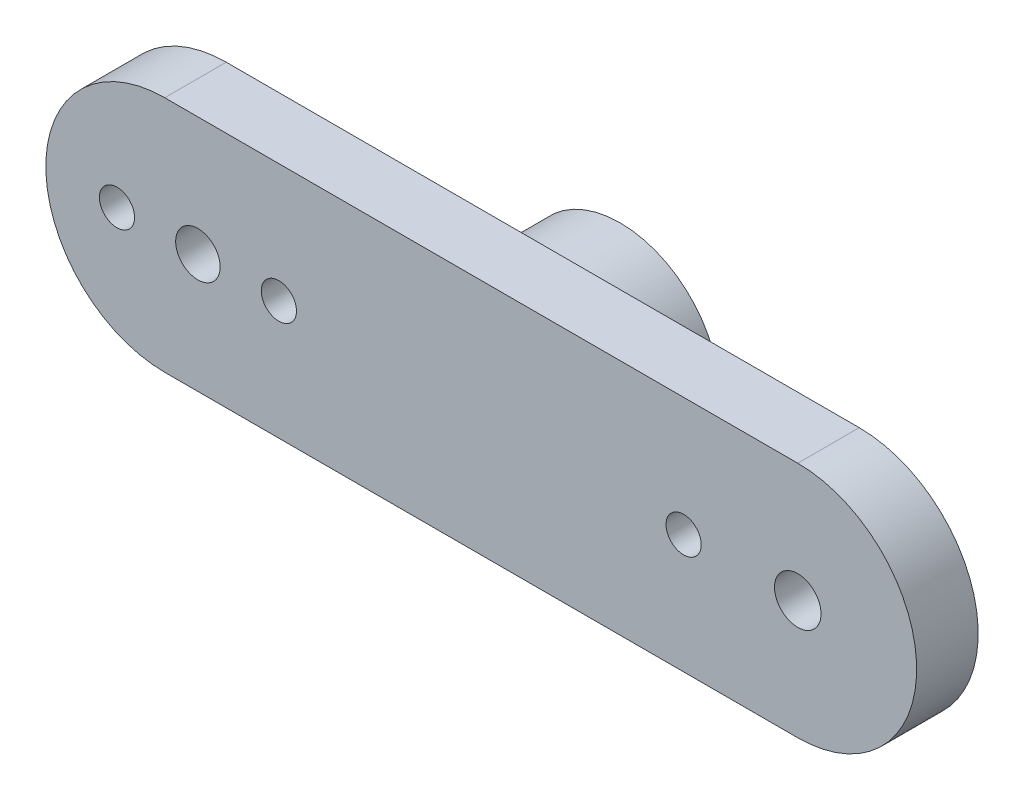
from build123d import *

# Parameters (mm, degrees)
SKETCH1_R           = 4.915
SKETCH1_R_2         = 2.96
BOSS_EXTRUDE1_DEPTH = 3.82
SKETCH2_R           = 0.87
SKETCH2_R_2         = 1.1
SKETCH2_R_3         = 1.15
BOSS_EXTRUDE2_DEPTH = 3.04


with BuildPart() as part:
    # Sketch1 → Boss-Extrude1 (new body)
    with BuildSketch(Plane.XY):
        with Locations((14.942156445, 11.028361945)):
            Circle(SKETCH1_R)
        with Locations((14.942156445, 11.028361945)):
            Circle(SKETCH1_R_2, mode=Mode.SUBTRACT)
    extrude(amount=BOSS_EXTRUDE1_DEPTH)

    # Sketch2 → Boss-Extrude2 (add)
    with BuildSketch(Plane.XY.offset(3.82)):
        with BuildLine():
            Line((30.582156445, 5.153361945), (-0.697843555, 5.153361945))
            ThreePointArc((-0.697843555, 5.153361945), (-6.572843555, 11.028361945), (-0.697843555, 16.903361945))
            Line((-0.697843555, 16.903361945), (30.582156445, 16.903361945))
            ThreePointArc((30.582156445, 16.903361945), (36.457156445, 11.028361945), (30.582156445, 5.153361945))
        make_face()
        with Locations((4.942156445, 11.028361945)):
            Circle(SKETCH2_R, mode=Mode.SUBTRACT)
        with Locations((0.942156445, 11.028361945)):
            Circle(SKETCH2_R_2, mode=Mode.SUBTRACT)
        with Locations((-3.057843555, 11.028361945)):
            Circle(SKETCH2_R, mode=Mode.SUBTRACT)
        with Locations(Location((24.942156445, 11.028361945, 0), (0, 0, 180))):
            Circle(SKETCH2_R, mode=Mode.SUBTRACT)
        with Locations((30.582156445, 11.028361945)):
            Circle(SKETCH2_R_3, mode=Mode.SUBTRACT)
    extrude(amount=BOSS_EXTRUDE2_DEPTH)


solid = part.part
